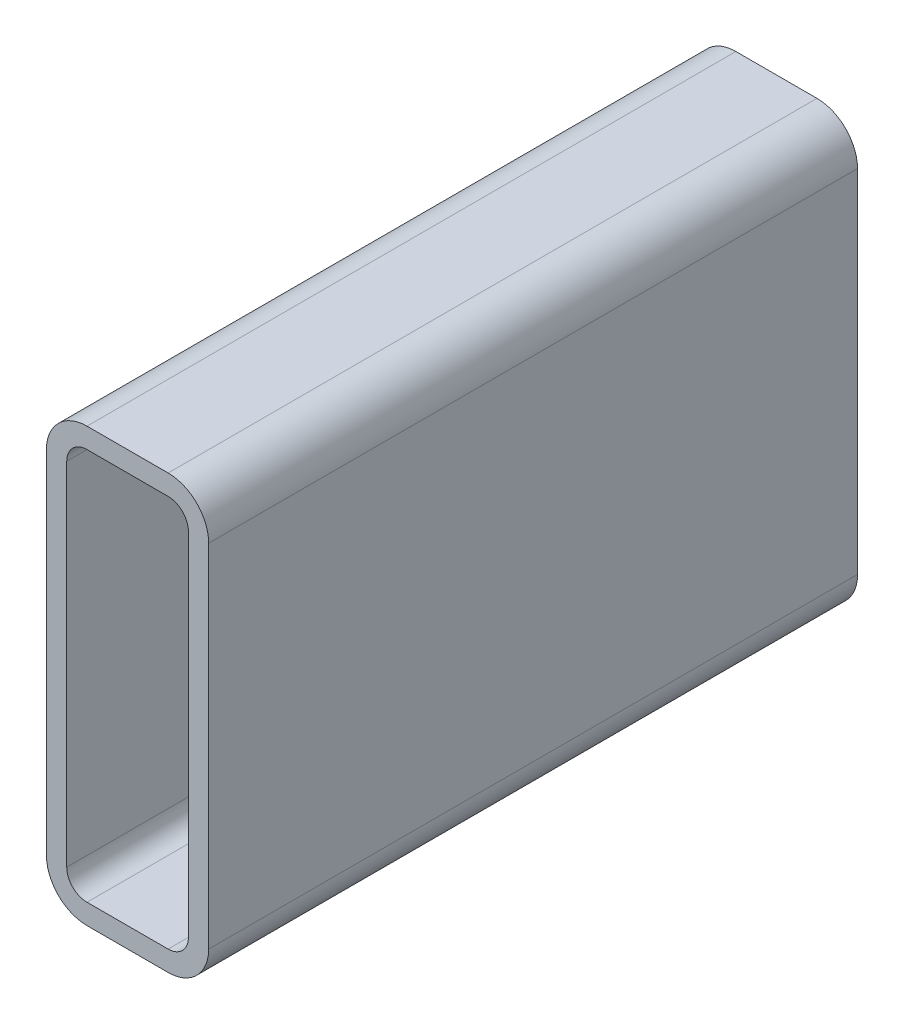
ISO-10303-21;
HEADER;
FILE_DESCRIPTION(('STEP AP214'),'2;1');
FILE_NAME('part.step','',(''),(''),'','','');
FILE_SCHEMA(('AUTOMOTIVE_DESIGN { 1 0 10303 214 1 1 1 1 }'));
ENDSEC;
DATA;
#1=APPLICATION_CONTEXT('core data for automotive mechanical design processes');
#2=APPLICATION_PROTOCOL_DEFINITION('international standard','automotive_design',2000,#1);
#3=PRODUCT_CONTEXT('',#1,'mechanical');
#4=PRODUCT('Part','Part','',(#3));
#5=PRODUCT_RELATED_PRODUCT_CATEGORY('part','',(#4));
#6=PRODUCT_DEFINITION_FORMATION('','',#4);
#7=PRODUCT_DEFINITION_CONTEXT('part definition',#1,'design');
#8=PRODUCT_DEFINITION('design','',#6,#7);
#9=PRODUCT_DEFINITION_SHAPE('','',#8);
#10=(LENGTH_UNIT() NAMED_UNIT(*) SI_UNIT(.MILLI.,.METRE.));
#11=(NAMED_UNIT(*) PLANE_ANGLE_UNIT() SI_UNIT($,.RADIAN.));
#12=(NAMED_UNIT(*) SI_UNIT($,.STERADIAN.) SOLID_ANGLE_UNIT());
#13=UNCERTAINTY_MEASURE_WITH_UNIT(LENGTH_MEASURE(1.E-05),#10,'distance_accuracy_value','');
#14=(GEOMETRIC_REPRESENTATION_CONTEXT(3) GLOBAL_UNCERTAINTY_ASSIGNED_CONTEXT((#13)) GLOBAL_UNIT_ASSIGNED_CONTEXT((#10,
#11,#12)) REPRESENTATION_CONTEXT('',''));
#15=CARTESIAN_POINT('',(0.,0.,0.));
#16=DIRECTION('',(0.,0.,1.));
#17=DIRECTION('',(1.,0.,0.));
#18=AXIS2_PLACEMENT_3D('',#15,#16,#17);
#19=CARTESIAN_POINT('',(21.5391160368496,186.116130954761,304.8));
#20=DIRECTION('',(0.,0.,1.));
#21=DIRECTION('',(1.,0.,0.));
#22=AXIS2_PLACEMENT_3D('',#19,#20,#21);
#23=PLANE('',#22);
#24=CARTESIAN_POINT('',(21.5391160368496,186.116130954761,304.8));
#25=DIRECTION('',(0.,0.,1.));
#26=DIRECTION('',(1.,0.,0.));
#27=AXIS2_PLACEMENT_3D('',#24,#25,#26);
#28=CIRCLE('',#27,19.05);
#29=CARTESIAN_POINT('',(21.5391160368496,205.166130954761,304.8));
#30=VERTEX_POINT('',#29);
#31=CARTESIAN_POINT('',(2.48911603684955,186.116130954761,304.8));
#32=VERTEX_POINT('',#31);
#33=EDGE_CURVE('E211',#30,#32,#28,.T.);
#34=ORIENTED_EDGE('',*,*,#33,.T.);
#35=DIRECTION('',(0.,-1.,0.));
#36=VECTOR('',#35,1.);
#37=CARTESIAN_POINT('',(2.48911603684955,21.0161309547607,304.8));
#38=LINE('',#37,#36);
#39=CARTESIAN_POINT('',(2.48911603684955,21.0161309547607,304.8));
#40=VERTEX_POINT('',#39);
#41=EDGE_CURVE('E214',#32,#40,#38,.T.);
#42=ORIENTED_EDGE('',*,*,#41,.T.);
#43=CARTESIAN_POINT('',(21.5391160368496,21.0161309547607,304.8));
#44=DIRECTION('',(0.,0.,1.));
#45=DIRECTION('',(1.,0.,0.));
#46=AXIS2_PLACEMENT_3D('',#43,#44,#45);
#47=CIRCLE('',#46,19.05);
#48=CARTESIAN_POINT('',(21.5391160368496,1.96613095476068,304.8));
#49=VERTEX_POINT('',#48);
#50=EDGE_CURVE('E217',#40,#49,#47,.T.);
#51=ORIENTED_EDGE('',*,*,#50,.T.);
#52=DIRECTION('',(1.,0.,0.));
#53=VECTOR('',#52,1.);
#54=CARTESIAN_POINT('',(59.6391160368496,1.96613095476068,304.8));
#55=LINE('',#54,#53);
#56=CARTESIAN_POINT('',(59.6391160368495,1.96613095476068,304.8));
#57=VERTEX_POINT('',#56);
#58=EDGE_CURVE('E219',#49,#57,#55,.T.);
#59=ORIENTED_EDGE('',*,*,#58,.T.);
#60=CARTESIAN_POINT('',(59.6391160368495,21.0161309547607,304.8));
#61=DIRECTION('',(0.,0.,1.));
#62=DIRECTION('',(1.,0.,0.));
#63=AXIS2_PLACEMENT_3D('',#60,#61,#62);
#64=CIRCLE('',#63,19.05);
#65=CARTESIAN_POINT('',(78.6891160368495,21.0161309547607,304.8));
#66=VERTEX_POINT('',#65);
#67=EDGE_CURVE('E221',#57,#66,#64,.T.);
#68=ORIENTED_EDGE('',*,*,#67,.T.);
#69=DIRECTION('',(0.,1.,0.));
#70=VECTOR('',#69,1.);
#71=CARTESIAN_POINT('',(78.6891160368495,186.116130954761,304.8));
#72=LINE('',#71,#70);
#73=CARTESIAN_POINT('',(78.6891160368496,186.116130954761,304.8));
#74=VERTEX_POINT('',#73);
#75=EDGE_CURVE('E223',#66,#74,#72,.T.);
#76=ORIENTED_EDGE('',*,*,#75,.T.);
#77=CARTESIAN_POINT('',(59.6391160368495,186.116130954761,304.8));
#78=DIRECTION('',(0.,0.,1.));
#79=DIRECTION('',(1.,0.,0.));
#80=AXIS2_PLACEMENT_3D('',#77,#78,#79);
#81=CIRCLE('',#80,19.05);
#82=CARTESIAN_POINT('',(59.6391160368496,205.166130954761,304.8));
#83=VERTEX_POINT('',#82);
#84=EDGE_CURVE('E225',#74,#83,#81,.T.);
#85=ORIENTED_EDGE('',*,*,#84,.T.);
#86=DIRECTION('',(-1.,0.,0.));
#87=VECTOR('',#86,1.);
#88=CARTESIAN_POINT('',(21.5391160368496,205.166130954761,304.8));
#89=LINE('',#88,#87);
#90=EDGE_CURVE('E227',#83,#30,#89,.T.);
#91=ORIENTED_EDGE('',*,*,#90,.T.);
#92=EDGE_LOOP('',(#34,#42,#51,#59,#68,#76,#85,#91));
#93=FACE_BOUND('',#92,.T.);
#94=DIRECTION('',(0.,-1.,0.));
#95=VECTOR('',#94,1.);
#96=CARTESIAN_POINT('',(12.0141160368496,21.0161309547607,304.8));
#97=LINE('',#96,#95);
#98=CARTESIAN_POINT('',(12.0141160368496,186.116130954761,304.8));
#99=VERTEX_POINT('',#98);
#100=CARTESIAN_POINT('',(12.0141160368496,21.0161309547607,304.8));
#101=VERTEX_POINT('',#100);
#102=EDGE_CURVE('E154',#99,#101,#97,.T.);
#103=ORIENTED_EDGE('',*,*,#102,.F.);
#104=CARTESIAN_POINT('',(21.5391160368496,186.116130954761,304.8));
#105=DIRECTION('',(0.,0.,1.));
#106=DIRECTION('',(1.,0.,0.));
#107=AXIS2_PLACEMENT_3D('',#104,#105,#106);
#108=CIRCLE('',#107,9.52500000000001);
#109=CARTESIAN_POINT('',(21.5391160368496,195.641130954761,304.8));
#110=VERTEX_POINT('',#109);
#111=EDGE_CURVE('E146',#110,#99,#108,.T.);
#112=ORIENTED_EDGE('',*,*,#111,.F.);
#113=DIRECTION('',(-1.,0.,0.));
#114=VECTOR('',#113,1.);
#115=CARTESIAN_POINT('',(21.5391160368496,195.641130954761,304.8));
#116=LINE('',#115,#114);
#117=CARTESIAN_POINT('',(59.6391160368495,195.641130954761,304.8));
#118=VERTEX_POINT('',#117);
#119=EDGE_CURVE('E179',#118,#110,#116,.T.);
#120=ORIENTED_EDGE('',*,*,#119,.F.);
#121=CARTESIAN_POINT('',(59.6391160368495,186.116130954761,304.8));
#122=DIRECTION('',(0.,0.,1.));
#123=DIRECTION('',(1.,0.,0.));
#124=AXIS2_PLACEMENT_3D('',#121,#122,#123);
#125=CIRCLE('',#124,9.52500000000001);
#126=CARTESIAN_POINT('',(69.1641160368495,186.116130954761,304.8));
#127=VERTEX_POINT('',#126);
#128=EDGE_CURVE('E177',#127,#118,#125,.T.);
#129=ORIENTED_EDGE('',*,*,#128,.F.);
#130=DIRECTION('',(0.,1.,0.));
#131=VECTOR('',#130,1.);
#132=CARTESIAN_POINT('',(69.1641160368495,186.116130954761,304.8));
#133=LINE('',#132,#131);
#134=CARTESIAN_POINT('',(69.1641160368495,21.0161309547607,304.8));
#135=VERTEX_POINT('',#134);
#136=EDGE_CURVE('E175',#135,#127,#133,.T.);
#137=ORIENTED_EDGE('',*,*,#136,.F.);
#138=CARTESIAN_POINT('',(59.6391160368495,21.0161309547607,304.8));
#139=DIRECTION('',(0.,0.,1.));
#140=DIRECTION('',(1.,0.,0.));
#141=AXIS2_PLACEMENT_3D('',#138,#139,#140);
#142=CIRCLE('',#141,9.525);
#143=CARTESIAN_POINT('',(59.6391160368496,11.4911309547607,304.8));
#144=VERTEX_POINT('',#143);
#145=EDGE_CURVE('E173',#144,#135,#142,.T.);
#146=ORIENTED_EDGE('',*,*,#145,.F.);
#147=DIRECTION('',(1.,0.,0.));
#148=VECTOR('',#147,1.);
#149=CARTESIAN_POINT('',(59.6391160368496,11.4911309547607,304.8));
#150=LINE('',#149,#148);
#151=CARTESIAN_POINT('',(21.5391160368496,11.4911309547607,304.8));
#152=VERTEX_POINT('',#151);
#153=EDGE_CURVE('E169',#152,#144,#150,.T.);
#154=ORIENTED_EDGE('',*,*,#153,.F.);
#155=CARTESIAN_POINT('',(21.5391160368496,21.0161309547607,304.8));
#156=DIRECTION('',(0.,0.,1.));
#157=DIRECTION('',(1.,0.,0.));
#158=AXIS2_PLACEMENT_3D('',#155,#156,#157);
#159=CIRCLE('',#158,9.525);
#160=EDGE_CURVE('E167',#101,#152,#159,.T.);
#161=ORIENTED_EDGE('',*,*,#160,.F.);
#162=EDGE_LOOP('',(#103,#112,#120,#129,#137,#146,#154,#161));
#163=FACE_BOUND('',#162,.T.);
#164=ADVANCED_FACE('F33',(#93,#163),#23,.T.);
#165=CARTESIAN_POINT('',(21.5391160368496,186.116130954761,0.));
#166=DIRECTION('',(0.,0.,1.));
#167=DIRECTION('',(1.,0.,0.));
#168=AXIS2_PLACEMENT_3D('',#165,#166,#167);
#169=PLANE('',#168);
#170=CARTESIAN_POINT('',(21.5391160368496,186.116130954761,0.));
#171=DIRECTION('',(0.,0.,1.));
#172=DIRECTION('',(1.,0.,0.));
#173=AXIS2_PLACEMENT_3D('',#170,#171,#172);
#174=CIRCLE('',#173,19.05);
#175=CARTESIAN_POINT('',(21.5391160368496,205.166130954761,0.));
#176=VERTEX_POINT('',#175);
#177=CARTESIAN_POINT('',(2.48911603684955,186.116130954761,0.));
#178=VERTEX_POINT('',#177);
#179=EDGE_CURVE('E162',#176,#178,#174,.T.);
#180=ORIENTED_EDGE('',*,*,#179,.F.);
#181=DIRECTION('',(-1.,0.,0.));
#182=VECTOR('',#181,1.);
#183=CARTESIAN_POINT('',(21.5391160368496,205.166130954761,0.));
#184=LINE('',#183,#182);
#185=CARTESIAN_POINT('',(59.6391160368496,205.166130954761,0.));
#186=VERTEX_POINT('',#185);
#187=EDGE_CURVE('E215',#186,#176,#184,.T.);
#188=ORIENTED_EDGE('',*,*,#187,.F.);
#189=CARTESIAN_POINT('',(59.6391160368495,186.116130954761,0.));
#190=DIRECTION('',(0.,0.,1.));
#191=DIRECTION('',(1.,0.,0.));
#192=AXIS2_PLACEMENT_3D('',#189,#190,#191);
#193=CIRCLE('',#192,19.05);
#194=CARTESIAN_POINT('',(78.6891160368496,186.116130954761,0.));
#195=VERTEX_POINT('',#194);
#196=EDGE_CURVE('E242',#195,#186,#193,.T.);
#197=ORIENTED_EDGE('',*,*,#196,.F.);
#198=DIRECTION('',(0.,1.,0.));
#199=VECTOR('',#198,1.);
#200=CARTESIAN_POINT('',(78.6891160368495,186.116130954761,0.));
#201=LINE('',#200,#199);
#202=CARTESIAN_POINT('',(78.6891160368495,21.0161309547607,0.));
#203=VERTEX_POINT('',#202);
#204=EDGE_CURVE('E240',#203,#195,#201,.T.);
#205=ORIENTED_EDGE('',*,*,#204,.F.);
#206=CARTESIAN_POINT('',(59.6391160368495,21.0161309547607,0.));
#207=DIRECTION('',(0.,0.,1.));
#208=DIRECTION('',(1.,0.,0.));
#209=AXIS2_PLACEMENT_3D('',#206,#207,#208);
#210=CIRCLE('',#209,19.05);
#211=CARTESIAN_POINT('',(59.6391160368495,1.96613095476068,0.));
#212=VERTEX_POINT('',#211);
#213=EDGE_CURVE('E238',#212,#203,#210,.T.);
#214=ORIENTED_EDGE('',*,*,#213,.F.);
#215=DIRECTION('',(1.,0.,0.));
#216=VECTOR('',#215,1.);
#217=CARTESIAN_POINT('',(59.6391160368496,1.96613095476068,0.));
#218=LINE('',#217,#216);
#219=CARTESIAN_POINT('',(21.5391160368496,1.96613095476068,0.));
#220=VERTEX_POINT('',#219);
#221=EDGE_CURVE('E236',#220,#212,#218,.T.);
#222=ORIENTED_EDGE('',*,*,#221,.F.);
#223=CARTESIAN_POINT('',(21.5391160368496,21.0161309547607,0.));
#224=DIRECTION('',(0.,0.,1.));
#225=DIRECTION('',(1.,0.,0.));
#226=AXIS2_PLACEMENT_3D('',#223,#224,#225);
#227=CIRCLE('',#226,19.05);
#228=CARTESIAN_POINT('',(2.48911603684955,21.0161309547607,0.));
#229=VERTEX_POINT('',#228);
#230=EDGE_CURVE('E234',#229,#220,#227,.T.);
#231=ORIENTED_EDGE('',*,*,#230,.F.);
#232=DIRECTION('',(0.,-1.,0.));
#233=VECTOR('',#232,1.);
#234=CARTESIAN_POINT('',(2.48911603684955,21.0161309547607,0.));
#235=LINE('',#234,#233);
#236=EDGE_CURVE('E232',#178,#229,#235,.T.);
#237=ORIENTED_EDGE('',*,*,#236,.F.);
#238=EDGE_LOOP('',(#180,#188,#197,#205,#214,#222,#231,#237));
#239=FACE_BOUND('',#238,.T.);
#240=CARTESIAN_POINT('',(21.5391160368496,186.116130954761,0.));
#241=DIRECTION('',(0.,0.,1.));
#242=DIRECTION('',(1.,0.,0.));
#243=AXIS2_PLACEMENT_3D('',#240,#241,#242);
#244=CIRCLE('',#243,9.52500000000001);
#245=CARTESIAN_POINT('',(21.5391160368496,195.641130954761,0.));
#246=VERTEX_POINT('',#245);
#247=CARTESIAN_POINT('',(12.0141160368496,186.116130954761,0.));
#248=VERTEX_POINT('',#247);
#249=EDGE_CURVE('E56',#246,#248,#244,.T.);
#250=ORIENTED_EDGE('',*,*,#249,.T.);
#251=DIRECTION('',(0.,-1.,0.));
#252=VECTOR('',#251,1.);
#253=CARTESIAN_POINT('',(12.0141160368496,21.0161309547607,0.));
#254=LINE('',#253,#252);
#255=CARTESIAN_POINT('',(12.0141160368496,21.0161309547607,0.));
#256=VERTEX_POINT('',#255);
#257=EDGE_CURVE('E161',#248,#256,#254,.T.);
#258=ORIENTED_EDGE('',*,*,#257,.T.);
#259=CARTESIAN_POINT('',(21.5391160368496,21.0161309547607,0.));
#260=DIRECTION('',(0.,0.,1.));
#261=DIRECTION('',(1.,0.,0.));
#262=AXIS2_PLACEMENT_3D('',#259,#260,#261);
#263=CIRCLE('',#262,9.525);
#264=CARTESIAN_POINT('',(21.5391160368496,11.4911309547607,0.));
#265=VERTEX_POINT('',#264);
#266=EDGE_CURVE('E183',#256,#265,#263,.T.);
#267=ORIENTED_EDGE('',*,*,#266,.T.);
#268=DIRECTION('',(1.,0.,0.));
#269=VECTOR('',#268,1.);
#270=CARTESIAN_POINT('',(59.6391160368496,11.4911309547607,0.));
#271=LINE('',#270,#269);
#272=CARTESIAN_POINT('',(59.6391160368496,11.4911309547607,0.));
#273=VERTEX_POINT('',#272);
#274=EDGE_CURVE('E186',#265,#273,#271,.T.);
#275=ORIENTED_EDGE('',*,*,#274,.T.);
#276=CARTESIAN_POINT('',(59.6391160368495,21.0161309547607,0.));
#277=DIRECTION('',(0.,0.,1.));
#278=DIRECTION('',(1.,0.,0.));
#279=AXIS2_PLACEMENT_3D('',#276,#277,#278);
#280=CIRCLE('',#279,9.525);
#281=CARTESIAN_POINT('',(69.1641160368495,21.0161309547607,0.));
#282=VERTEX_POINT('',#281);
#283=EDGE_CURVE('E189',#273,#282,#280,.T.);
#284=ORIENTED_EDGE('',*,*,#283,.T.);
#285=DIRECTION('',(0.,1.,0.));
#286=VECTOR('',#285,1.);
#287=CARTESIAN_POINT('',(69.1641160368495,186.116130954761,0.));
#288=LINE('',#287,#286);
#289=CARTESIAN_POINT('',(69.1641160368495,186.116130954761,0.));
#290=VERTEX_POINT('',#289);
#291=EDGE_CURVE('E192',#282,#290,#288,.T.);
#292=ORIENTED_EDGE('',*,*,#291,.T.);
#293=CARTESIAN_POINT('',(59.6391160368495,186.116130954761,0.));
#294=DIRECTION('',(0.,0.,1.));
#295=DIRECTION('',(1.,0.,0.));
#296=AXIS2_PLACEMENT_3D('',#293,#294,#295);
#297=CIRCLE('',#296,9.52500000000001);
#298=CARTESIAN_POINT('',(59.6391160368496,195.641130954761,0.));
#299=VERTEX_POINT('',#298);
#300=EDGE_CURVE('E195',#290,#299,#297,.T.);
#301=ORIENTED_EDGE('',*,*,#300,.T.);
#302=DIRECTION('',(-1.,0.,0.));
#303=VECTOR('',#302,1.);
#304=CARTESIAN_POINT('',(21.5391160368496,195.641130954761,0.));
#305=LINE('',#304,#303);
#306=EDGE_CURVE('E155',#299,#246,#305,.T.);
#307=ORIENTED_EDGE('',*,*,#306,.T.);
#308=EDGE_LOOP('',(#250,#258,#267,#275,#284,#292,#301,#307));
#309=FACE_BOUND('',#308,.T.);
#310=ADVANCED_FACE('F272',(#239,#309),#169,.F.);
#311=CARTESIAN_POINT('',(21.5391160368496,186.116130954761,304.8));
#312=DIRECTION('',(0.,0.,-1.));
#313=DIRECTION('',(-1.,0.,0.));
#314=AXIS2_PLACEMENT_3D('',#311,#312,#313);
#315=CYLINDRICAL_SURFACE('',#314,19.05);
#316=ORIENTED_EDGE('',*,*,#179,.T.);
#317=DIRECTION('',(0.,0.,-1.));
#318=VECTOR('',#317,1.);
#319=CARTESIAN_POINT('',(2.48911603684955,186.116130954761,304.8));
#320=LINE('',#319,#318);
#321=EDGE_CURVE('E11',#32,#178,#320,.T.);
#322=ORIENTED_EDGE('',*,*,#321,.F.);
#323=ORIENTED_EDGE('',*,*,#33,.F.);
#324=DIRECTION('',(0.,0.,-1.));
#325=VECTOR('',#324,1.);
#326=CARTESIAN_POINT('',(21.5391160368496,205.166130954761,304.8));
#327=LINE('',#326,#325);
#328=EDGE_CURVE('E229',#30,#176,#327,.T.);
#329=ORIENTED_EDGE('',*,*,#328,.T.);
#330=EDGE_LOOP('',(#316,#322,#323,#329));
#331=FACE_BOUND('',#330,.T.);
#332=ADVANCED_FACE('F35',(#331),#315,.T.);
#333=CARTESIAN_POINT('',(2.48911603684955,21.0161309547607,304.8));
#334=DIRECTION('',(1.,0.,0.));
#335=DIRECTION('',(0.,0.,-1.));
#336=AXIS2_PLACEMENT_3D('',#333,#334,#335);
#337=PLANE('',#336);
#338=ORIENTED_EDGE('',*,*,#236,.T.);
#339=DIRECTION('',(0.,0.,-1.));
#340=VECTOR('',#339,1.);
#341=CARTESIAN_POINT('',(2.48911603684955,21.0161309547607,304.8));
#342=LINE('',#341,#340);
#343=EDGE_CURVE('E41',#40,#229,#342,.T.);
#344=ORIENTED_EDGE('',*,*,#343,.F.);
#345=ORIENTED_EDGE('',*,*,#41,.F.);
#346=ORIENTED_EDGE('',*,*,#321,.T.);
#347=EDGE_LOOP('',(#338,#344,#345,#346));
#348=FACE_BOUND('',#347,.T.);
#349=ADVANCED_FACE('F289',(#348),#337,.F.);
#350=CARTESIAN_POINT('',(21.5391160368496,21.0161309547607,304.8));
#351=DIRECTION('',(0.,0.,-1.));
#352=DIRECTION('',(-1.,0.,0.));
#353=AXIS2_PLACEMENT_3D('',#350,#351,#352);
#354=CYLINDRICAL_SURFACE('',#353,19.05);
#355=ORIENTED_EDGE('',*,*,#230,.T.);
#356=DIRECTION('',(0.,0.,-1.));
#357=VECTOR('',#356,1.);
#358=CARTESIAN_POINT('',(21.5391160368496,1.96613095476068,304.8));
#359=LINE('',#358,#357);
#360=EDGE_CURVE('E259',#49,#220,#359,.T.);
#361=ORIENTED_EDGE('',*,*,#360,.F.);
#362=ORIENTED_EDGE('',*,*,#50,.F.);
#363=ORIENTED_EDGE('',*,*,#343,.T.);
#364=EDGE_LOOP('',(#355,#361,#362,#363));
#365=FACE_BOUND('',#364,.T.);
#366=ADVANCED_FACE('F266',(#365),#354,.T.);
#367=CARTESIAN_POINT('',(59.6391160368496,1.96613095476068,304.8));
#368=DIRECTION('',(0.,1.,0.));
#369=DIRECTION('',(0.,0.,1.));
#370=AXIS2_PLACEMENT_3D('',#367,#368,#369);
#371=PLANE('',#370);
#372=ORIENTED_EDGE('',*,*,#221,.T.);
#373=DIRECTION('',(0.,0.,-1.));
#374=VECTOR('',#373,1.);
#375=CARTESIAN_POINT('',(59.6391160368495,1.96613095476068,304.8));
#376=LINE('',#375,#374);
#377=EDGE_CURVE('E256',#57,#212,#376,.T.);
#378=ORIENTED_EDGE('',*,*,#377,.F.);
#379=ORIENTED_EDGE('',*,*,#58,.F.);
#380=ORIENTED_EDGE('',*,*,#360,.T.);
#381=EDGE_LOOP('',(#372,#378,#379,#380));
#382=FACE_BOUND('',#381,.T.);
#383=ADVANCED_FACE('F278',(#382),#371,.F.);
#384=CARTESIAN_POINT('',(59.6391160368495,21.0161309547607,304.8));
#385=DIRECTION('',(0.,0.,-1.));
#386=DIRECTION('',(-1.,0.,0.));
#387=AXIS2_PLACEMENT_3D('',#384,#385,#386);
#388=CYLINDRICAL_SURFACE('',#387,19.05);
#389=ORIENTED_EDGE('',*,*,#213,.T.);
#390=DIRECTION('',(0.,0.,-1.));
#391=VECTOR('',#390,1.);
#392=CARTESIAN_POINT('',(78.6891160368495,21.0161309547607,304.8));
#393=LINE('',#392,#391);
#394=EDGE_CURVE('E253',#66,#203,#393,.T.);
#395=ORIENTED_EDGE('',*,*,#394,.F.);
#396=ORIENTED_EDGE('',*,*,#67,.F.);
#397=ORIENTED_EDGE('',*,*,#377,.T.);
#398=EDGE_LOOP('',(#389,#395,#396,#397));
#399=FACE_BOUND('',#398,.T.);
#400=ADVANCED_FACE('F282',(#399),#388,.T.);
#401=CARTESIAN_POINT('',(78.6891160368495,186.116130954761,304.8));
#402=DIRECTION('',(-1.,0.,0.));
#403=DIRECTION('',(0.,0.,1.));
#404=AXIS2_PLACEMENT_3D('',#401,#402,#403);
#405=PLANE('',#404);
#406=ORIENTED_EDGE('',*,*,#204,.T.);
#407=DIRECTION('',(0.,0.,-1.));
#408=VECTOR('',#407,1.);
#409=CARTESIAN_POINT('',(78.6891160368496,186.116130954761,304.8));
#410=LINE('',#409,#408);
#411=EDGE_CURVE('E250',#74,#195,#410,.T.);
#412=ORIENTED_EDGE('',*,*,#411,.F.);
#413=ORIENTED_EDGE('',*,*,#75,.F.);
#414=ORIENTED_EDGE('',*,*,#394,.T.);
#415=EDGE_LOOP('',(#406,#412,#413,#414));
#416=FACE_BOUND('',#415,.T.);
#417=ADVANCED_FACE('F302',(#416),#405,.F.);
#418=CARTESIAN_POINT('',(59.6391160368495,186.116130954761,304.8));
#419=DIRECTION('',(0.,0.,-1.));
#420=DIRECTION('',(-1.,0.,0.));
#421=AXIS2_PLACEMENT_3D('',#418,#419,#420);
#422=CYLINDRICAL_SURFACE('',#421,19.05);
#423=ORIENTED_EDGE('',*,*,#196,.T.);
#424=DIRECTION('',(0.,0.,-1.));
#425=VECTOR('',#424,1.);
#426=CARTESIAN_POINT('',(59.6391160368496,205.166130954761,304.8));
#427=LINE('',#426,#425);
#428=EDGE_CURVE('E247',#83,#186,#427,.T.);
#429=ORIENTED_EDGE('',*,*,#428,.F.);
#430=ORIENTED_EDGE('',*,*,#84,.F.);
#431=ORIENTED_EDGE('',*,*,#411,.T.);
#432=EDGE_LOOP('',(#423,#429,#430,#431));
#433=FACE_BOUND('',#432,.T.);
#434=ADVANCED_FACE('F300',(#433),#422,.T.);
#435=CARTESIAN_POINT('',(21.5391160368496,205.166130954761,304.8));
#436=DIRECTION('',(0.,-1.,0.));
#437=DIRECTION('',(0.,0.,-1.));
#438=AXIS2_PLACEMENT_3D('',#435,#436,#437);
#439=PLANE('',#438);
#440=ORIENTED_EDGE('',*,*,#187,.T.);
#441=ORIENTED_EDGE('',*,*,#328,.F.);
#442=ORIENTED_EDGE('',*,*,#90,.F.);
#443=ORIENTED_EDGE('',*,*,#428,.T.);
#444=EDGE_LOOP('',(#440,#441,#442,#443));
#445=FACE_BOUND('',#444,.T.);
#446=ADVANCED_FACE('F295',(#445),#439,.F.);
#447=CARTESIAN_POINT('',(21.5391160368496,186.116130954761,304.8));
#448=DIRECTION('',(0.,0.,-1.));
#449=DIRECTION('',(-1.,0.,0.));
#450=AXIS2_PLACEMENT_3D('',#447,#448,#449);
#451=CYLINDRICAL_SURFACE('',#450,9.52500000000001);
#452=ORIENTED_EDGE('',*,*,#249,.F.);
#453=DIRECTION('',(0.,0.,-1.));
#454=VECTOR('',#453,1.);
#455=CARTESIAN_POINT('',(21.5391160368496,195.641130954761,304.8));
#456=LINE('',#455,#454);
#457=EDGE_CURVE('E150',#110,#246,#456,.T.);
#458=ORIENTED_EDGE('',*,*,#457,.F.);
#459=ORIENTED_EDGE('',*,*,#111,.T.);
#460=DIRECTION('',(0.,0.,-1.));
#461=VECTOR('',#460,1.);
#462=CARTESIAN_POINT('',(12.0141160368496,186.116130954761,304.8));
#463=LINE('',#462,#461);
#464=EDGE_CURVE('E149',#99,#248,#463,.T.);
#465=ORIENTED_EDGE('',*,*,#464,.T.);
#466=EDGE_LOOP('',(#452,#458,#459,#465));
#467=FACE_BOUND('',#466,.T.);
#468=ADVANCED_FACE('F148',(#467),#451,.F.);
#469=CARTESIAN_POINT('',(12.0141160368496,21.0161309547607,304.8));
#470=DIRECTION('',(1.,0.,0.));
#471=DIRECTION('',(0.,0.,-1.));
#472=AXIS2_PLACEMENT_3D('',#469,#470,#471);
#473=PLANE('',#472);
#474=ORIENTED_EDGE('',*,*,#257,.F.);
#475=ORIENTED_EDGE('',*,*,#464,.F.);
#476=ORIENTED_EDGE('',*,*,#102,.T.);
#477=DIRECTION('',(0.,0.,-1.));
#478=VECTOR('',#477,1.);
#479=CARTESIAN_POINT('',(12.0141160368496,21.0161309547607,304.8));
#480=LINE('',#479,#478);
#481=EDGE_CURVE('E163',#101,#256,#480,.T.);
#482=ORIENTED_EDGE('',*,*,#481,.T.);
#483=EDGE_LOOP('',(#474,#475,#476,#482));
#484=FACE_BOUND('',#483,.T.);
#485=ADVANCED_FACE('F158',(#484),#473,.T.);
#486=CARTESIAN_POINT('',(21.5391160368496,21.0161309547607,304.8));
#487=DIRECTION('',(0.,0.,-1.));
#488=DIRECTION('',(-1.,0.,0.));
#489=AXIS2_PLACEMENT_3D('',#486,#487,#488);
#490=CYLINDRICAL_SURFACE('',#489,9.525);
#491=ORIENTED_EDGE('',*,*,#266,.F.);
#492=ORIENTED_EDGE('',*,*,#481,.F.);
#493=ORIENTED_EDGE('',*,*,#160,.T.);
#494=DIRECTION('',(0.,0.,-1.));
#495=VECTOR('',#494,1.);
#496=CARTESIAN_POINT('',(21.5391160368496,11.4911309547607,304.8));
#497=LINE('',#496,#495);
#498=EDGE_CURVE('E208',#152,#265,#497,.T.);
#499=ORIENTED_EDGE('',*,*,#498,.T.);
#500=EDGE_LOOP('',(#491,#492,#493,#499));
#501=FACE_BOUND('',#500,.T.);
#502=ADVANCED_FACE('F327',(#501),#490,.F.);
#503=CARTESIAN_POINT('',(59.6391160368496,11.4911309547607,304.8));
#504=DIRECTION('',(0.,1.,0.));
#505=DIRECTION('',(0.,0.,1.));
#506=AXIS2_PLACEMENT_3D('',#503,#504,#505);
#507=PLANE('',#506);
#508=ORIENTED_EDGE('',*,*,#274,.F.);
#509=ORIENTED_EDGE('',*,*,#498,.F.);
#510=ORIENTED_EDGE('',*,*,#153,.T.);
#511=DIRECTION('',(0.,0.,-1.));
#512=VECTOR('',#511,1.);
#513=CARTESIAN_POINT('',(59.6391160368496,11.4911309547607,304.8));
#514=LINE('',#513,#512);
#515=EDGE_CURVE('E206',#144,#273,#514,.T.);
#516=ORIENTED_EDGE('',*,*,#515,.T.);
#517=EDGE_LOOP('',(#508,#509,#510,#516));
#518=FACE_BOUND('',#517,.T.);
#519=ADVANCED_FACE('F331',(#518),#507,.T.);
#520=CARTESIAN_POINT('',(59.6391160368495,21.0161309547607,304.8));
#521=DIRECTION('',(0.,0.,-1.));
#522=DIRECTION('',(-1.,0.,0.));
#523=AXIS2_PLACEMENT_3D('',#520,#521,#522);
#524=CYLINDRICAL_SURFACE('',#523,9.525);
#525=ORIENTED_EDGE('',*,*,#283,.F.);
#526=ORIENTED_EDGE('',*,*,#515,.F.);
#527=ORIENTED_EDGE('',*,*,#145,.T.);
#528=DIRECTION('',(0.,0.,-1.));
#529=VECTOR('',#528,1.);
#530=CARTESIAN_POINT('',(69.1641160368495,21.0161309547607,304.8));
#531=LINE('',#530,#529);
#532=EDGE_CURVE('E204',#135,#282,#531,.T.);
#533=ORIENTED_EDGE('',*,*,#532,.T.);
#534=EDGE_LOOP('',(#525,#526,#527,#533));
#535=FACE_BOUND('',#534,.T.);
#536=ADVANCED_FACE('F337',(#535),#524,.F.);
#537=CARTESIAN_POINT('',(69.1641160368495,186.116130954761,304.8));
#538=DIRECTION('',(-1.,0.,0.));
#539=DIRECTION('',(0.,0.,1.));
#540=AXIS2_PLACEMENT_3D('',#537,#538,#539);
#541=PLANE('',#540);
#542=ORIENTED_EDGE('',*,*,#291,.F.);
#543=ORIENTED_EDGE('',*,*,#532,.F.);
#544=ORIENTED_EDGE('',*,*,#136,.T.);
#545=DIRECTION('',(0.,0.,-1.));
#546=VECTOR('',#545,1.);
#547=CARTESIAN_POINT('',(69.1641160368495,186.116130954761,304.8));
#548=LINE('',#547,#546);
#549=EDGE_CURVE('E202',#127,#290,#548,.T.);
#550=ORIENTED_EDGE('',*,*,#549,.T.);
#551=EDGE_LOOP('',(#542,#543,#544,#550));
#552=FACE_BOUND('',#551,.T.);
#553=ADVANCED_FACE('F341',(#552),#541,.T.);
#554=CARTESIAN_POINT('',(59.6391160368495,186.116130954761,304.8));
#555=DIRECTION('',(0.,0.,-1.));
#556=DIRECTION('',(-1.,0.,0.));
#557=AXIS2_PLACEMENT_3D('',#554,#555,#556);
#558=CYLINDRICAL_SURFACE('',#557,9.52500000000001);
#559=ORIENTED_EDGE('',*,*,#300,.F.);
#560=ORIENTED_EDGE('',*,*,#549,.F.);
#561=ORIENTED_EDGE('',*,*,#128,.T.);
#562=DIRECTION('',(0.,0.,-1.));
#563=VECTOR('',#562,1.);
#564=CARTESIAN_POINT('',(59.6391160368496,195.641130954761,304.8));
#565=LINE('',#564,#563);
#566=EDGE_CURVE('E48',#118,#299,#565,.T.);
#567=ORIENTED_EDGE('',*,*,#566,.T.);
#568=EDGE_LOOP('',(#559,#560,#561,#567));
#569=FACE_BOUND('',#568,.T.);
#570=ADVANCED_FACE('F345',(#569),#558,.F.);
#571=CARTESIAN_POINT('',(21.5391160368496,195.641130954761,304.8));
#572=DIRECTION('',(0.,-1.,0.));
#573=DIRECTION('',(0.,0.,-1.));
#574=AXIS2_PLACEMENT_3D('',#571,#572,#573);
#575=PLANE('',#574);
#576=ORIENTED_EDGE('',*,*,#306,.F.);
#577=ORIENTED_EDGE('',*,*,#566,.F.);
#578=ORIENTED_EDGE('',*,*,#119,.T.);
#579=ORIENTED_EDGE('',*,*,#457,.T.);
#580=EDGE_LOOP('',(#576,#577,#578,#579));
#581=FACE_BOUND('',#580,.T.);
#582=ADVANCED_FACE('F349',(#581),#575,.T.);
#583=CLOSED_SHELL('',(#164,#310,#332,#349,#366,#383,#400,#417,#434,#446,#468,#485,#502,#519,
#536,#553,#570,#582));
#584=MANIFOLD_SOLID_BREP('B2',#583);
#585=ADVANCED_BREP_SHAPE_REPRESENTATION('',(#18,#584),#14);
#586=SHAPE_DEFINITION_REPRESENTATION(#9,#585);
ENDSEC;
END-ISO-10303-21;
